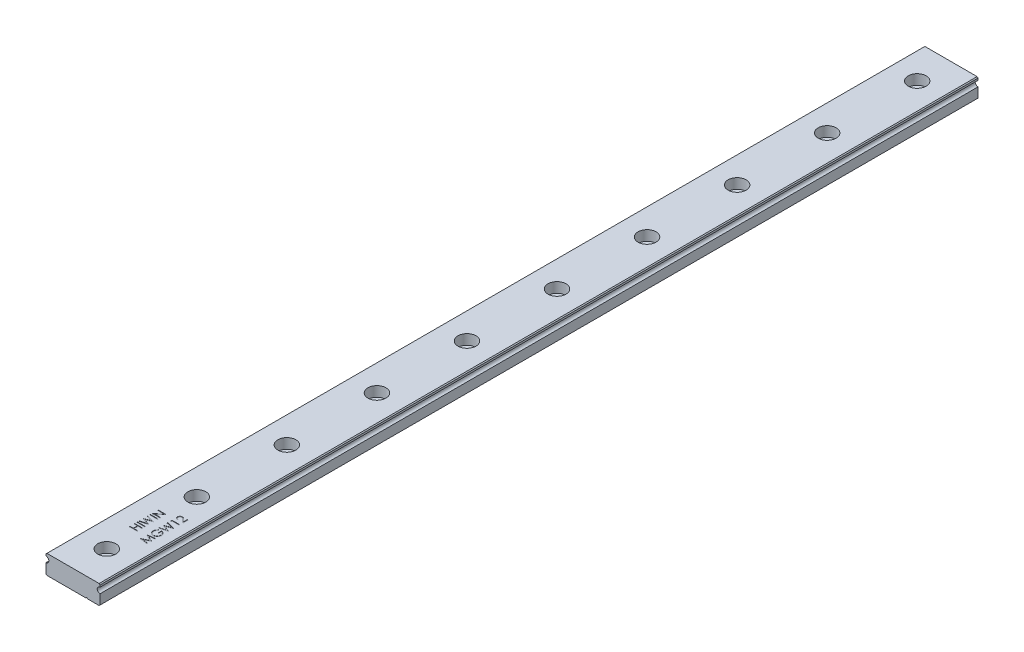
from build123d import *

# Parameters (mm, degrees)
EXTRUDE_1_DEPTH              = 390
HOLE_WIZARD_M4_1_D           = 4.5
HOLE_WIZARD_M4_1_CBORE_D     = 8
HOLE_WIZARD_M4_1_CBORE_DEPTH = 4.5
PATTERN_LINEAR_1_COUNT       = 10
PATTERN_LINEAR_1_PITCH       = 40
SKETCH_4_W                   = 3.5
SKETCH_4_H                   = 0.314102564
CUT_EXTRUDE_1_DEPTH          = 0.1


with BuildPart() as part:
    # Sketch 1 → Extrude 1 (new body)
    with BuildSketch(Plane.XY):
        with BuildLine():
            Line((-11.6, 8.5), (-12, 8.1))
            Line((-12, 8.1), (-12, 7.25))
            ThreePointArc((-12, 7.25), (-10.75, 6), (-12, 4.75))
            Line((-12, 4.75), (-12, 0.4))
            Line((-12, 0.4), (-11.6, 0))
            Line((-11.6, 0), (5.7, 0))
            ThreePointArc((5.7, 0), (6, 0.3), (6.3, 0))
            Line((6.3, 0), (11.6, 0))
            Line((11.6, 0), (12, 0.4))
            Line((12, 0.4), (12, 4.75))
            ThreePointArc((12, 4.75), (10.75, 6), (12, 7.25))
            Line((12, 7.25), (12, 8.1))
            Line((12, 8.1), (11.6, 8.5))
            Line((11.6, 8.5), (-11.6, 8.5))
        make_face()
    extrude(amount=-EXTRUDE_1_DEPTH)

    # Hole Wizard M4 _1 (through all)
    with Locations(Plane(origin=(-2.175360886, 8.5, -52.975227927), x_dir=(-1, 0, 0), z_dir=(0, 1, 0))):
        with Locations((-2.175360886, 37.975227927)):
            hole_wizard_m4_1 = CounterBoreHole(HOLE_WIZARD_M4_1_D / 2, HOLE_WIZARD_M4_1_CBORE_D / 2, HOLE_WIZARD_M4_1_CBORE_DEPTH)

    # Pattern Linear 1: Hole Wizard M4 _1 ×10
    with Locations(*[(0, 0, -i * PATTERN_LINEAR_1_PITCH) for i in range(1, PATTERN_LINEAR_1_COUNT)]):
        add(hole_wizard_m4_1, mode=Mode.SUBTRACT)

    # Sketch 4 → Cut-Extrude 1 (cut)
    with BuildSketch(Plane(origin=(0, 8.5, 0), x_dir=(1, 0, 0), z_dir=(0, 1, 0))):
        Polygon((-3.5, 28.538461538), (-3.5, 28.852564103), (-2.064102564, 28.852564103), (-2.064102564, 30.647435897), (-3.5, 30.647435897), (-3.5, 30.961538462), (0, 30.961538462), (0, 30.647435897), (-1.705128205, 30.647435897), (-1.705128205, 28.852564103), (0, 28.852564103), (0, 28.538461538), align=None)
        with Locations((-1.75, 32.016025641)):
            Rectangle(SKETCH_4_W, SKETCH_4_H)
        Polygon((-3.5, 32.711538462), (-3.5, 33.036157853), (-0.933193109, 33.721153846), (-3.5, 34.739883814), (-3.5, 34.785456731), (-0.950721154, 35.78525641), (-3.5, 36.473758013), (-3.5, 36.794871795), (0, 35.851161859), (0, 35.806290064), (-2.676883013, 34.753205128), (0, 33.6875), (0, 33.642628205), align=None)
        with Locations((-1.75, 37.759615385)):
            Rectangle(SKETCH_4_W, SKETCH_4_H)
        Polygon((0, 38.679487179), (-3.5, 38.679487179), (-3.5, 38.745392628), (-0.745292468, 41.057692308), (-3.5, 41.057692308), (-3.5, 41.371794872), (0, 41.371794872), (0, 41.300280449), (-2.748397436, 38.993589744), (0, 38.993589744), align=None)
        Polygon((6.967948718, 25.913461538), (3.467948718, 26.375500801), (3.467948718, 26.420372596), (6.33974359, 27.865384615), (3.467948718, 29.306891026), (3.467948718, 29.352463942), (6.967948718, 29.817307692), (6.967948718, 29.501802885), (4.449519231, 29.166666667), (6.967948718, 27.903245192), (6.967948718, 27.832431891), (4.443910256, 26.564102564), (6.967948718, 26.229667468), align=None)
        with BuildLine():
            Line((4.065304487, 33.810897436), (4.320512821, 33.541666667))
            add(Edge.make_bspline(
                [(4.320512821, 33.541666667), (4.274666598, 33.492957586), (4.184067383, 33.396700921), (4.066704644, 33.239500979), (3.965171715, 33.076145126), (3.883176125, 32.906369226), (3.818854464, 32.734625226), (3.7720985, 32.563866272), (3.742488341, 32.395197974), (3.738931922, 32.283033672), (3.737179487, 32.227764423)],
                knots=[0, 0, 0, 0, 1.089067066, 2.152164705, 3.18986567, 4.218445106, 5.218487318, 6.173592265, 7.100032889, 8, 8, 8, 8], degree=3))
            add(Edge.make_bspline(
                [(3.737179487, 32.227764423), (3.737593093, 32.193849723), (3.738419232, 32.126108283), (3.748963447, 32.025486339), (3.764128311, 31.925919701), (3.786070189, 31.827596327), (3.813879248, 31.730325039), (3.848664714, 31.634444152), (3.889219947, 31.53977478), (3.936082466, 31.447208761), (3.987562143, 31.357468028), (4.044611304, 31.272712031), (4.105397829, 31.19239557), (4.171457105, 31.118046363), (4.242141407, 31.049169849), (4.316177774, 30.984499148), (4.395021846, 30.92523957), (4.478349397, 30.87245393), (4.56422185, 30.824786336), (4.651910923, 30.783594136), (4.740602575, 30.747784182), (4.83096464, 30.720510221), (4.922065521, 30.697409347), (5.014382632, 30.681328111), (5.108157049, 30.672231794), (5.170954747, 30.670661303), (5.202524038, 30.669871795)],
                knots=[0, 0, 0, 0, 1.028150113, 2.053633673, 3.06513288, 4.081487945, 5.106702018, 6.131327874, 7.172780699, 8.228344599, 9.276313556, 10.308389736, 11.324843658, 12.329040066, 13.321460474, 14.316307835, 15.308626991, 16.309440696, 17.305625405, 18.28535951, 19.246194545, 20.203493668, 21.145557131, 22.095268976, 23.042464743, 24, 24, 24, 24], degree=3))
            add(Edge.make_bspline(
                [(5.202524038, 30.669871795), (5.2347947, 30.67062799), (5.299247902, 30.672138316), (5.395444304, 30.681791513), (5.490200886, 30.699746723), (5.583666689, 30.723558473), (5.676027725, 30.753831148), (5.767187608, 30.791023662), (5.857137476, 30.835329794), (5.944984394, 30.886501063), (6.030484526, 30.943010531), (6.111697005, 31.005161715), (6.187676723, 31.073059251), (6.259533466, 31.145458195), (6.326813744, 31.223018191), (6.388706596, 31.306491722), (6.446169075, 31.394710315), (6.498569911, 31.487713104), (6.545377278, 31.584517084), (6.587001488, 31.683773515), (6.621280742, 31.785801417), (6.649218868, 31.890064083), (6.672119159, 31.996437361), (6.686851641, 32.105461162), (6.697542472, 32.216333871), (6.698324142, 32.291072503), (6.698717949, 32.328725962)],
                knots=[0, 0, 0, 0, 0.935915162, 1.869274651, 2.799799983, 3.730201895, 4.664668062, 5.616159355, 6.583070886, 7.570012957, 8.562524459, 9.553461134, 10.53281078, 11.515274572, 12.509912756, 13.507571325, 14.526460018, 15.561318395, 16.601025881, 17.643204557, 18.680545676, 19.719612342, 20.772381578, 21.833430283, 22.908478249, 24, 24, 24, 24], degree=3))
            add(Edge.make_bspline(
                [(6.698717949, 32.328725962), (6.697769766, 32.374104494), (6.695907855, 32.463212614), (6.681401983, 32.594196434), (6.658775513, 32.720009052), (6.625536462, 32.84024089), (6.583464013, 32.955328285), (6.531435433, 33.064846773), (6.469998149, 33.169098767), (6.400396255, 33.267633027), (6.322847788, 33.358107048), (6.239913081, 33.440449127), (6.15051765, 33.511827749), (6.0559938, 33.574375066), (5.955437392, 33.62607231), (5.84940783, 33.668518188), (5.737839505, 33.701050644), (5.660747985, 33.714405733), (5.621794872, 33.721153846)],
                knots=[0, 0, 0, 0, 1.130199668, 2.219330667, 3.279027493, 4.311506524, 5.322739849, 6.327972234, 7.327472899, 8.33386792, 9.329086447, 10.29244429, 11.240784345, 12.174119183, 13.111530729, 14.052100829, 15.015757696, 16, 16, 16, 16], degree=3))
            Line((5.621794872, 33.721153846), (5.621794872, 32.554487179))
            Line((5.621794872, 32.554487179), (5.262820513, 32.554487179))
            Line((5.262820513, 32.554487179), (5.262820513, 34.03525641))
            add(Edge.make_bspline(
                [(5.262820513, 34.03525641), (5.329728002, 34.033550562), (5.460678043, 34.030211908), (5.651648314, 34.006792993), (5.832020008, 33.968976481), (6.001983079, 33.917316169), (6.161296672, 33.850440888), (6.310122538, 33.76906836), (6.447499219, 33.671896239), (6.574548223, 33.562385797), (6.687877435, 33.43948584), (6.787483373, 33.30651722), (6.871385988, 33.163260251), (6.93964665, 33.009850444), (6.992920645, 32.84679001), (7.030692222, 32.673701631), (7.053322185, 32.49082003), (7.056213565, 32.365483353), (7.057692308, 32.301382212)],
                knots=[0, 0, 0, 0, 1.140356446, 2.231883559, 3.274166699, 4.278491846, 5.25512956, 6.21435461, 7.1637429, 8.11826594, 9.068280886, 10.0076534, 10.945064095, 11.891975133, 12.864533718, 13.863980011, 14.907571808, 16, 16, 16, 16], degree=3))
            add(Edge.make_bspline(
                [(7.057692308, 32.301382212), (7.057123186, 32.261872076), (7.056000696, 32.183945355), (7.048023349, 32.068854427), (7.035742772, 31.956936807), (7.017197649, 31.848208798), (6.994482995, 31.742270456), (6.965396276, 31.639650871), (6.931727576, 31.539959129), (6.893431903, 31.443041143), (6.849060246, 31.349776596), (6.799750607, 31.259750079), (6.745757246, 31.172463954), (6.6861464, 31.088512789), (6.62136394, 31.007459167), (6.551280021, 30.929825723), (6.476108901, 30.855177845), (6.422729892, 30.808417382), (6.395833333, 30.784855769)],
                knots=[0, 0, 0, 0, 1.107784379, 2.184907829, 3.233506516, 4.263428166, 5.276301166, 6.270063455, 7.25232949, 8.225834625, 9.190232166, 10.146266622, 11.1027726, 12.066435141, 13.031522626, 14.010570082, 14.99756817, 16, 16, 16, 16], degree=3))
            add(Edge.make_bspline(
                [(6.395833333, 30.784855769), (6.35316268, 30.750669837), (6.268529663, 30.682865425), (6.132929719, 30.595587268), (5.992527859, 30.521185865), (5.84693323, 30.460818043), (5.696282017, 30.413679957), (5.540766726, 30.379873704), (5.380187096, 30.360066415), (5.271521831, 30.357212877), (5.216546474, 30.355769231)],
                knots=[0, 0, 0, 0, 1.023165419, 2.029347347, 3.013907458, 3.994755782, 4.975994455, 5.96558838, 6.970761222, 8, 8, 8, 8], degree=3))
            add(Edge.make_bspline(
                [(5.216546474, 30.355769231), (5.175380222, 30.356301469), (5.093570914, 30.35735918), (4.972113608, 30.370184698), (4.85281291, 30.38858611), (4.735766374, 30.415633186), (4.620895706, 30.449729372), (4.508148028, 30.492283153), (4.397455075, 30.541826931), (4.289585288, 30.599416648), (4.185945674, 30.663485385), (4.087043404, 30.733093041), (3.994481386, 30.808776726), (3.908045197, 30.890756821), (3.826453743, 30.977380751), (3.751411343, 31.070467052), (3.681743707, 31.168605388), (3.618789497, 31.272556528), (3.562221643, 31.380680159), (3.512633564, 31.492741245), (3.471649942, 31.608699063), (3.436876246, 31.72768662), (3.411161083, 31.850604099), (3.392512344, 31.976559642), (3.379751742, 32.106209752), (3.378725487, 32.193845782), (3.378205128, 32.23828125)],
                knots=[0, 0, 0, 0, 1.00895651, 2.005089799, 2.991467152, 3.967318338, 4.948153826, 5.927364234, 6.919980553, 7.91976625, 8.923240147, 9.905815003, 10.88314567, 11.851989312, 12.825009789, 13.798721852, 14.781296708, 15.773896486, 16.776076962, 17.771600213, 18.775744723, 19.78957137, 20.808953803, 21.851964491, 22.910847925, 24, 24, 24, 24], degree=3))
            add(Edge.make_bspline(
                [(3.378205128, 32.23828125), (3.37878462, 32.274519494), (3.379933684, 32.346375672), (3.387898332, 32.453301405), (3.400522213, 32.558574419), (3.417749, 32.662350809), (3.44121269, 32.764277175), (3.469290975, 32.864643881), (3.501982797, 32.963596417), (3.540971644, 33.060824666), (3.585225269, 33.156982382), (3.635038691, 33.252604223), (3.691263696, 33.347363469), (3.754067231, 33.44142445), (3.822370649, 33.535380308), (3.898127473, 33.62774495), (3.978350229, 33.720747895), (4.036032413, 33.780549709), (4.065304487, 33.810897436)],
                knots=[0, 0, 0, 0, 0.985871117, 1.954866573, 2.915460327, 3.869826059, 4.81536089, 5.759505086, 6.70452669, 7.649098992, 8.607881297, 9.583363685, 10.581137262, 11.603961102, 12.659522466, 13.73993555, 14.853081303, 16, 16, 16, 16], degree=3))
        make_face()
        Polygon((3.467948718, 34.528846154), (3.467948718, 34.853465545), (6.034755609, 35.538461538), (3.467948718, 36.557191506), (3.467948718, 36.602764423), (6.017227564, 37.602564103), (3.467948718, 38.291065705), (3.467948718, 38.612179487), (6.967948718, 37.668469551), (6.967948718, 37.623597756), (4.291065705, 36.570512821), (6.967948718, 35.504807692), (6.967948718, 35.459935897), align=None)
        Polygon((3.467948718, 39.849659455), (3.467948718, 40.496794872), (6.967948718, 40.496794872), (6.967948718, 40.182692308), (3.826923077, 40.182692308), (3.826923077, 39.644230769), align=None)
        with BuildLine():
            Line((4.544871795, 42.246794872), (4.544871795, 41.932692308))
            add(Edge.make_bspline(
                [(4.544871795, 41.932692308), (4.503200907, 41.934739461), (4.421360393, 41.938760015), (4.302036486, 41.957588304), (4.187981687, 41.984529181), (4.080111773, 42.022620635), (3.977472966, 42.069926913), (3.880472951, 42.12665694), (3.789481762, 42.193850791), (3.705342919, 42.270057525), (3.628155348, 42.352826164), (3.561500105, 42.442132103), (3.505182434, 42.535977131), (3.458101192, 42.63407653), (3.422761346, 42.737537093), (3.396539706, 42.845419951), (3.38076336, 42.958199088), (3.379067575, 43.03503911), (3.378205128, 43.07411859)],
                knots=[0, 0, 0, 0, 1.10065271, 2.161652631, 3.183658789, 4.190468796, 5.17591951, 6.163126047, 7.15150782, 8.156236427, 9.156009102, 10.134482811, 11.092018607, 12.041330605, 13.001268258, 13.972401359, 14.968799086, 16, 16, 16, 16], degree=3))
            add(Edge.make_bspline(
                [(3.378205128, 43.07411859), (3.379096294, 43.112499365), (3.380847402, 43.187916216), (3.396111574, 43.297940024), (3.419502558, 43.402929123), (3.454164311, 43.501693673), (3.497657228, 43.595247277), (3.55174637, 43.682431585), (3.613872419, 43.765354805), (3.68715314, 43.83994721), (3.765343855, 43.908469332), (3.848850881, 43.967531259), (3.935199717, 44.018395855), (4.025064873, 44.060026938), (4.118738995, 44.09158515), (4.215323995, 44.114966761), (4.31593453, 44.128332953), (4.384043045, 44.130373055), (4.418669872, 44.131410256)],
                knots=[0, 0, 0, 0, 1.111674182, 2.184400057, 3.212814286, 4.223731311, 5.211378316, 6.196328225, 7.191884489, 8.207283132, 9.220262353, 10.201199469, 11.166417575, 12.120932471, 13.06540007, 14.026332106, 14.996573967, 16, 16, 16, 16], degree=3))
            add(Edge.make_bspline(
                [(4.418669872, 44.131410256), (4.467417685, 44.129716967), (4.564057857, 44.126360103), (4.706073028, 44.097646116), (4.843665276, 44.052798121), (4.954406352, 43.998805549), (5.043631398, 43.944322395), (5.117131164, 43.895274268), (5.196249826, 43.837528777), (5.281307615, 43.771579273), (5.371190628, 43.696290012), (5.46773272, 43.613617), (5.569148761, 43.521425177), (5.63846241, 43.456776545), (5.674379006, 43.423277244)],
                knots=[0, 0, 0, 0, 1.184416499, 2.348048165, 3.509039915, 4.696071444, 5.333504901, 6.05069495, 6.844171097, 7.714965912, 8.667477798, 9.695072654, 10.805644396, 12, 12, 12, 12], degree=3))
            Line((5.674379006, 43.423277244), (6.608974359, 42.547576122))
            Line((6.608974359, 42.547576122), (6.608974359, 44.176282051))
            Line((6.608974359, 44.176282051), (6.967948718, 44.176282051))
            Line((6.967948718, 44.176282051), (6.967948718, 41.798076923))
            Line((6.967948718, 41.798076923), (5.51943109, 43.155448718))
            add(Edge.make_bspline(
                [(5.51943109, 43.155448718), (5.484932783, 43.188496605), (5.418668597, 43.251974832), (5.321925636, 43.341757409), (5.232176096, 43.422396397), (5.149589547, 43.49441379), (5.072957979, 43.556247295), (5.004763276, 43.611119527), (4.942008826, 43.655085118), (4.869268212, 43.702800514), (4.780455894, 43.749014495), (4.671922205, 43.788726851), (4.560194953, 43.8129417), (4.484692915, 43.815846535), (4.446714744, 43.817307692)],
                knots=[0, 0, 0, 0, 1.329631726, 2.553950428, 3.673215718, 4.687767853, 5.603093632, 6.413772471, 7.123043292, 7.734684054, 8.834405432, 9.900288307, 10.943827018, 12, 12, 12, 12], degree=3))
            add(Edge.make_bspline(
                [(4.446714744, 43.817307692), (4.422833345, 43.81667195), (4.375767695, 43.815419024), (4.306761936, 43.804361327), (4.240197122, 43.78765082), (4.175868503, 43.763705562), (4.114422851, 43.732098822), (4.055785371, 43.693625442), (3.999096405, 43.649235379), (3.945943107, 43.59788411), (3.897261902, 43.54147259), (3.854137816, 43.48187834), (3.818098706, 43.418828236), (3.788555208, 43.352588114), (3.765379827, 43.283342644), (3.749321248, 43.210957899), (3.739238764, 43.135633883), (3.737874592, 43.084200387), (3.737179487, 43.057992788)],
                knots=[0, 0, 0, 0, 0.991446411, 1.95395049, 2.89581595, 3.838931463, 4.798493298, 5.75982156, 6.748411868, 7.785213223, 8.824556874, 9.840280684, 10.836137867, 11.835679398, 12.848801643, 13.863922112, 14.911575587, 16, 16, 16, 16], degree=3))
            add(Edge.make_bspline(
                [(3.737179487, 43.057992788), (3.737866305, 43.030615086), (3.739215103, 42.976849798), (3.749431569, 42.898078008), (3.764919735, 42.822414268), (3.789518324, 42.750987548), (3.818582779, 42.682251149), (3.855506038, 42.617672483), (3.898411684, 42.556179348), (3.948162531, 42.498783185), (4.004061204, 42.446362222), (4.0656654, 42.399655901), (4.132531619, 42.35911482), (4.204385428, 42.323693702), (4.281942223, 42.294941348), (4.364909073, 42.272967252), (4.452930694, 42.25558067), (4.513715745, 42.249772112), (4.544871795, 42.246794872)],
                knots=[0, 0, 0, 0, 1.030878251, 2.024474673, 2.987898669, 3.934362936, 4.864849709, 5.795128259, 6.730474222, 7.685293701, 8.650606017, 9.611896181, 10.591709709, 11.591680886, 12.625074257, 13.701333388, 14.821793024, 16, 16, 16, 16], degree=3))
        make_face()
    extrude(amount=-CUT_EXTRUDE_1_DEPTH, mode=Mode.SUBTRACT)


solid = part.part
